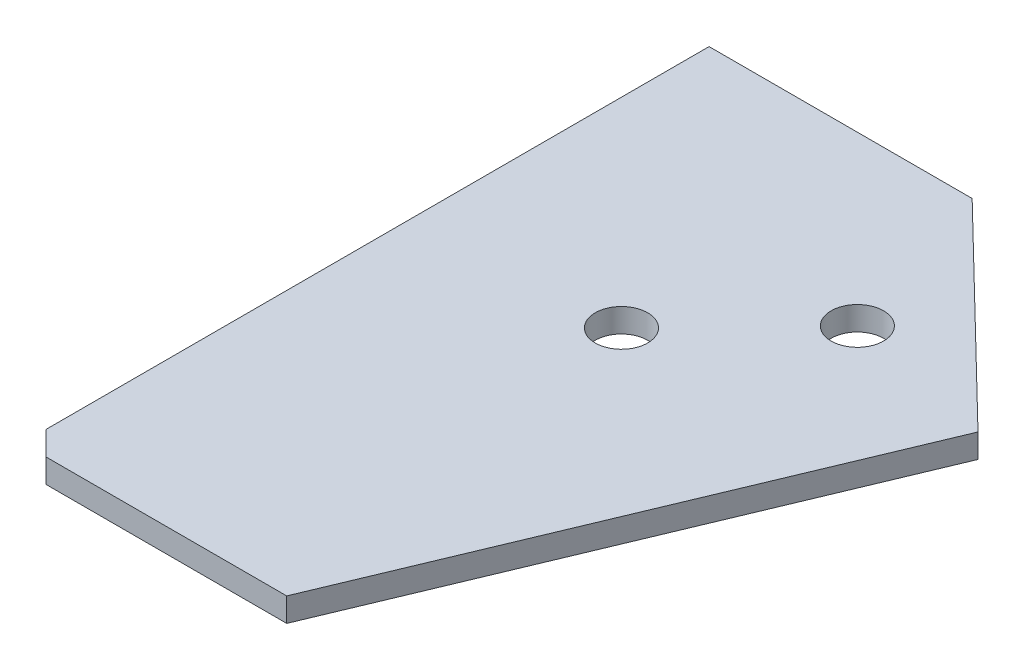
ISO-10303-21;
HEADER;
FILE_DESCRIPTION(('STEP AP214'),'2;1');
FILE_NAME('part.step','',(''),(''),'','','');
FILE_SCHEMA(('AUTOMOTIVE_DESIGN { 1 0 10303 214 1 1 1 1 }'));
ENDSEC;
DATA;
#1=APPLICATION_CONTEXT('core data for automotive mechanical design processes');
#2=APPLICATION_PROTOCOL_DEFINITION('international standard','automotive_design',2000,#1);
#3=PRODUCT_CONTEXT('',#1,'mechanical');
#4=PRODUCT('Part','Part','',(#3));
#5=PRODUCT_RELATED_PRODUCT_CATEGORY('part','',(#4));
#6=PRODUCT_DEFINITION_FORMATION('','',#4);
#7=PRODUCT_DEFINITION_CONTEXT('part definition',#1,'design');
#8=PRODUCT_DEFINITION('design','',#6,#7);
#9=PRODUCT_DEFINITION_SHAPE('','',#8);
#10=(LENGTH_UNIT() NAMED_UNIT(*) SI_UNIT(.MILLI.,.METRE.));
#11=(NAMED_UNIT(*) PLANE_ANGLE_UNIT() SI_UNIT($,.RADIAN.));
#12=(NAMED_UNIT(*) SI_UNIT($,.STERADIAN.) SOLID_ANGLE_UNIT());
#13=UNCERTAINTY_MEASURE_WITH_UNIT(LENGTH_MEASURE(1.E-05),#10,'distance_accuracy_value','');
#14=(GEOMETRIC_REPRESENTATION_CONTEXT(3) GLOBAL_UNCERTAINTY_ASSIGNED_CONTEXT((#13)) GLOBAL_UNIT_ASSIGNED_CONTEXT((#10,
#11,#12)) REPRESENTATION_CONTEXT('',''));
#15=CARTESIAN_POINT('',(0.,0.,0.));
#16=DIRECTION('',(0.,0.,1.));
#17=DIRECTION('',(1.,0.,0.));
#18=AXIS2_PLACEMENT_3D('',#15,#16,#17);
#19=CARTESIAN_POINT('',(0.,5.,0.));
#20=DIRECTION('',(1.,0.,0.));
#21=DIRECTION('',(0.,0.,-1.));
#22=AXIS2_PLACEMENT_3D('',#19,#20,#21);
#23=PLANE('',#22);
#24=DIRECTION('',(0.,0.,1.));
#25=VECTOR('',#24,1.);
#26=CARTESIAN_POINT('',(0.,-5.,0.));
#27=LINE('',#26,#25);
#28=CARTESIAN_POINT('',(0.,-5.,-288.223836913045));
#29=VERTEX_POINT('',#28);
#30=CARTESIAN_POINT('',(0.,-5.,-9.99999999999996));
#31=VERTEX_POINT('',#30);
#32=EDGE_CURVE('E121',#29,#31,#27,.T.);
#33=ORIENTED_EDGE('',*,*,#32,.T.);
#34=DIRECTION('',(0.,1.,0.));
#35=VECTOR('',#34,1.);
#36=CARTESIAN_POINT('',(0.,5.,-9.99999999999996));
#37=LINE('',#36,#35);
#38=CARTESIAN_POINT('',(0.,5.,-9.99999999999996));
#39=VERTEX_POINT('',#38);
#40=EDGE_CURVE('E45',#31,#39,#37,.T.);
#41=ORIENTED_EDGE('',*,*,#40,.T.);
#42=DIRECTION('',(0.,0.,1.));
#43=VECTOR('',#42,1.);
#44=CARTESIAN_POINT('',(0.,5.,0.));
#45=LINE('',#44,#43);
#46=CARTESIAN_POINT('',(0.,5.,-288.223836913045));
#47=VERTEX_POINT('',#46);
#48=EDGE_CURVE('E99',#47,#39,#45,.T.);
#49=ORIENTED_EDGE('',*,*,#48,.F.);
#50=DIRECTION('',(0.,-1.,0.));
#51=VECTOR('',#50,1.);
#52=CARTESIAN_POINT('',(0.,5.,-288.223836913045));
#53=LINE('',#52,#51);
#54=EDGE_CURVE('E120',#47,#29,#53,.T.);
#55=ORIENTED_EDGE('',*,*,#54,.T.);
#56=EDGE_LOOP('',(#33,#41,#49,#55));
#57=FACE_BOUND('',#56,.T.);
#58=ADVANCED_FACE('F37',(#57),#23,.F.);
#59=CARTESIAN_POINT('',(0.,5.,0.));
#60=DIRECTION('',(0.,0.,-1.));
#61=DIRECTION('',(-1.,0.,0.));
#62=AXIS2_PLACEMENT_3D('',#59,#60,#61);
#63=PLANE('',#62);
#64=DIRECTION('',(1.,0.,0.));
#65=VECTOR('',#64,1.);
#66=CARTESIAN_POINT('',(0.,5.,0.));
#67=LINE('',#66,#65);
#68=CARTESIAN_POINT('',(9.99999999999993,5.,0.));
#69=VERTEX_POINT('',#68);
#70=CARTESIAN_POINT('',(111.,5.,0.));
#71=VERTEX_POINT('',#70);
#72=EDGE_CURVE('E89',#69,#71,#67,.T.);
#73=ORIENTED_EDGE('',*,*,#72,.F.);
#74=DIRECTION('',(0.,-1.,0.));
#75=VECTOR('',#74,1.);
#76=CARTESIAN_POINT('',(9.99999999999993,5.,0.));
#77=LINE('',#76,#75);
#78=CARTESIAN_POINT('',(9.99999999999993,-5.,0.));
#79=VERTEX_POINT('',#78);
#80=EDGE_CURVE('E107',#69,#79,#77,.T.);
#81=ORIENTED_EDGE('',*,*,#80,.T.);
#82=DIRECTION('',(1.,0.,0.));
#83=VECTOR('',#82,1.);
#84=CARTESIAN_POINT('',(0.,-5.,0.));
#85=LINE('',#84,#83);
#86=CARTESIAN_POINT('',(111.,-5.,0.));
#87=VERTEX_POINT('',#86);
#88=EDGE_CURVE('E104',#79,#87,#85,.T.);
#89=ORIENTED_EDGE('',*,*,#88,.T.);
#90=DIRECTION('',(0.,-1.,0.));
#91=VECTOR('',#90,1.);
#92=CARTESIAN_POINT('',(111.,5.,0.));
#93=LINE('',#92,#91);
#94=EDGE_CURVE('E102',#71,#87,#93,.T.);
#95=ORIENTED_EDGE('',*,*,#94,.F.);
#96=EDGE_LOOP('',(#73,#81,#89,#95));
#97=FACE_BOUND('',#96,.T.);
#98=ADVANCED_FACE('F103',(#97),#63,.F.);
#99=CARTESIAN_POINT('',(111.,5.,0.));
#100=DIRECTION('',(-0.92275935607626,0.,-0.385376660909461));
#101=DIRECTION('',(-0.385376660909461,0.,0.92275935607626));
#102=AXIS2_PLACEMENT_3D('',#99,#100,#101);
#103=PLANE('',#102);
#104=DIRECTION('',(0.385376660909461,0.,-0.92275935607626));
#105=VECTOR('',#104,1.);
#106=CARTESIAN_POINT('',(111.,-5.,0.));
#107=LINE('',#106,#105);
#108=CARTESIAN_POINT('',(196.451283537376,-5.,-204.607542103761));
#109=VERTEX_POINT('',#108);
#110=EDGE_CURVE('E125',#87,#109,#107,.T.);
#111=ORIENTED_EDGE('',*,*,#110,.T.);
#112=DIRECTION('',(0.,-1.,0.));
#113=VECTOR('',#112,1.);
#114=CARTESIAN_POINT('',(196.451283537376,5.,-204.607542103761));
#115=LINE('',#114,#113);
#116=CARTESIAN_POINT('',(196.451283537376,5.,-204.607542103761));
#117=VERTEX_POINT('',#116);
#118=EDGE_CURVE('E108',#117,#109,#115,.T.);
#119=ORIENTED_EDGE('',*,*,#118,.F.);
#120=DIRECTION('',(0.385376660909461,0.,-0.92275935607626));
#121=VECTOR('',#120,1.);
#122=CARTESIAN_POINT('',(111.,5.,0.));
#123=LINE('',#122,#121);
#124=EDGE_CURVE('E93',#71,#117,#123,.T.);
#125=ORIENTED_EDGE('',*,*,#124,.F.);
#126=ORIENTED_EDGE('',*,*,#94,.T.);
#127=EDGE_LOOP('',(#111,#119,#125,#126));
#128=FACE_BOUND('',#127,.T.);
#129=ADVANCED_FACE('F110',(#128),#103,.F.);
#130=CARTESIAN_POINT('',(110.379713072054,5.,-288.223836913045));
#131=DIRECTION('',(-0.696802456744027,0.,0.717263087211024));
#132=DIRECTION('',(0.717263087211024,0.,0.696802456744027));
#133=AXIS2_PLACEMENT_3D('',#130,#131,#132);
#134=PLANE('',#133);
#135=DIRECTION('',(-0.717263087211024,0.,-0.696802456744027));
#136=VECTOR('',#135,1.);
#137=CARTESIAN_POINT('',(110.379713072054,-5.,-288.223836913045));
#138=LINE('',#137,#136);
#139=CARTESIAN_POINT('',(110.379713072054,-5.,-288.223836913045));
#140=VERTEX_POINT('',#139);
#141=EDGE_CURVE('E127',#109,#140,#138,.T.);
#142=ORIENTED_EDGE('',*,*,#141,.T.);
#143=DIRECTION('',(0.,-1.,0.));
#144=VECTOR('',#143,1.);
#145=CARTESIAN_POINT('',(110.379713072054,5.,-288.223836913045));
#146=LINE('',#145,#144);
#147=CARTESIAN_POINT('',(110.379713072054,5.,-288.223836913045));
#148=VERTEX_POINT('',#147);
#149=EDGE_CURVE('E133',#148,#140,#146,.T.);
#150=ORIENTED_EDGE('',*,*,#149,.F.);
#151=DIRECTION('',(-0.717263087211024,0.,-0.696802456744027));
#152=VECTOR('',#151,1.);
#153=CARTESIAN_POINT('',(110.379713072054,5.,-288.223836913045));
#154=LINE('',#153,#152);
#155=EDGE_CURVE('E113',#117,#148,#154,.T.);
#156=ORIENTED_EDGE('',*,*,#155,.F.);
#157=ORIENTED_EDGE('',*,*,#118,.T.);
#158=EDGE_LOOP('',(#142,#150,#156,#157));
#159=FACE_BOUND('',#158,.T.);
#160=ADVANCED_FACE('F143',(#159),#134,.F.);
#161=CARTESIAN_POINT('',(110.379713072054,5.,-288.223836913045));
#162=DIRECTION('',(0.,0.,1.));
#163=DIRECTION('',(1.,0.,0.));
#164=AXIS2_PLACEMENT_3D('',#161,#162,#163);
#165=PLANE('',#164);
#166=DIRECTION('',(-1.,0.,0.));
#167=VECTOR('',#166,1.);
#168=CARTESIAN_POINT('',(110.379713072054,-5.,-288.223836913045));
#169=LINE('',#168,#167);
#170=EDGE_CURVE('E129',#140,#29,#169,.T.);
#171=ORIENTED_EDGE('',*,*,#170,.T.);
#172=ORIENTED_EDGE('',*,*,#54,.F.);
#173=DIRECTION('',(-1.,0.,0.));
#174=VECTOR('',#173,1.);
#175=CARTESIAN_POINT('',(110.379713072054,5.,-288.223836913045));
#176=LINE('',#175,#174);
#177=EDGE_CURVE('E115',#148,#47,#176,.T.);
#178=ORIENTED_EDGE('',*,*,#177,.F.);
#179=ORIENTED_EDGE('',*,*,#149,.T.);
#180=EDGE_LOOP('',(#171,#172,#178,#179));
#181=FACE_BOUND('',#180,.T.);
#182=ADVANCED_FACE('F148',(#181),#165,.F.);
#183=CARTESIAN_POINT('',(0.,5.,-288.223836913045));
#184=DIRECTION('',(0.,1.,0.));
#185=DIRECTION('',(0.,0.,1.));
#186=AXIS2_PLACEMENT_3D('',#183,#184,#185);
#187=PLANE('',#186);
#188=CARTESIAN_POINT('',(132.613727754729,5.,-217.827469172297));
#189=DIRECTION('',(0.,1.,0.));
#190=DIRECTION('',(0.,0.,1.));
#191=AXIS2_PLACEMENT_3D('',#188,#189,#190);
#192=CIRCLE('',#191,11.);
#193=CARTESIAN_POINT('',(132.613727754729,5.,-206.827469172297));
#194=VERTEX_POINT('',#193);
#195=EDGE_CURVE('E158',#194,#194,#192,.T.);
#196=ORIENTED_EDGE('',*,*,#195,.F.);
#197=EDGE_LOOP('',(#196));
#198=FACE_BOUND('',#197,.T.);
#199=CARTESIAN_POINT('',(83.8375557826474,5.,-167.619053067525));
#200=DIRECTION('',(0.,1.,0.));
#201=DIRECTION('',(0.,0.,1.));
#202=AXIS2_PLACEMENT_3D('',#199,#200,#201);
#203=CIRCLE('',#202,11.);
#204=CARTESIAN_POINT('',(83.8375557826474,5.,-156.619053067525));
#205=VERTEX_POINT('',#204);
#206=EDGE_CURVE('E152',#205,#205,#203,.T.);
#207=ORIENTED_EDGE('',*,*,#206,.F.);
#208=EDGE_LOOP('',(#207));
#209=FACE_BOUND('',#208,.T.);
#210=ORIENTED_EDGE('',*,*,#48,.T.);
#211=DIRECTION('',(-0.707106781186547,0.,-0.707106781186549));
#212=VECTOR('',#211,1.);
#213=CARTESIAN_POINT('',(-139.111918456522,5.,-149.111918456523));
#214=LINE('',#213,#212);
#215=EDGE_CURVE('E11',#39,#69,#214,.F.);
#216=ORIENTED_EDGE('',*,*,#215,.T.);
#217=ORIENTED_EDGE('',*,*,#72,.T.);
#218=ORIENTED_EDGE('',*,*,#124,.T.);
#219=ORIENTED_EDGE('',*,*,#155,.T.);
#220=ORIENTED_EDGE('',*,*,#177,.T.);
#221=EDGE_LOOP('',(#210,#216,#217,#218,#219,#220));
#222=FACE_BOUND('',#221,.T.);
#223=ADVANCED_FACE('F91',(#198,#209,#222),#187,.T.);
#224=CARTESIAN_POINT('',(0.,-5.,-288.223836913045));
#225=DIRECTION('',(0.,1.,0.));
#226=DIRECTION('',(0.,0.,1.));
#227=AXIS2_PLACEMENT_3D('',#224,#225,#226);
#228=PLANE('',#227);
#229=CARTESIAN_POINT('',(132.613727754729,-5.,-217.827469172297));
#230=DIRECTION('',(0.,1.,0.));
#231=DIRECTION('',(0.,0.,1.));
#232=AXIS2_PLACEMENT_3D('',#229,#230,#231);
#233=CIRCLE('',#232,11.);
#234=CARTESIAN_POINT('',(132.613727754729,-5.,-206.827469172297));
#235=VERTEX_POINT('',#234);
#236=EDGE_CURVE('E155',#235,#235,#233,.T.);
#237=ORIENTED_EDGE('',*,*,#236,.T.);
#238=EDGE_LOOP('',(#237));
#239=FACE_BOUND('',#238,.T.);
#240=CARTESIAN_POINT('',(83.8375557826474,-5.,-167.619053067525));
#241=DIRECTION('',(0.,1.,0.));
#242=DIRECTION('',(0.,0.,1.));
#243=AXIS2_PLACEMENT_3D('',#240,#241,#242);
#244=CIRCLE('',#243,11.);
#245=CARTESIAN_POINT('',(83.8375557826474,-5.,-156.619053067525));
#246=VERTEX_POINT('',#245);
#247=EDGE_CURVE('E123',#246,#246,#244,.T.);
#248=ORIENTED_EDGE('',*,*,#247,.T.);
#249=EDGE_LOOP('',(#248));
#250=FACE_BOUND('',#249,.T.);
#251=ORIENTED_EDGE('',*,*,#88,.F.);
#252=DIRECTION('',(0.707106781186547,0.,0.707106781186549));
#253=VECTOR('',#252,1.);
#254=CARTESIAN_POINT('',(9.99999999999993,-5.,0.));
#255=LINE('',#254,#253);
#256=EDGE_CURVE('E59',#79,#31,#255,.F.);
#257=ORIENTED_EDGE('',*,*,#256,.T.);
#258=ORIENTED_EDGE('',*,*,#32,.F.);
#259=ORIENTED_EDGE('',*,*,#170,.F.);
#260=ORIENTED_EDGE('',*,*,#141,.F.);
#261=ORIENTED_EDGE('',*,*,#110,.F.);
#262=EDGE_LOOP('',(#251,#257,#258,#259,#260,#261));
#263=FACE_BOUND('',#262,.T.);
#264=ADVANCED_FACE('F139',(#239,#250,#263),#228,.F.);
#265=CARTESIAN_POINT('',(83.8375557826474,5.,-167.619053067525));
#266=DIRECTION('',(0.,1.,0.));
#267=DIRECTION('',(0.,0.,1.));
#268=AXIS2_PLACEMENT_3D('',#265,#266,#267);
#269=CYLINDRICAL_SURFACE('',#268,11.);
#270=ORIENTED_EDGE('',*,*,#247,.F.);
#271=EDGE_LOOP('',(#270));
#272=FACE_BOUND('',#271,.T.);
#273=ORIENTED_EDGE('',*,*,#206,.T.);
#274=EDGE_LOOP('',(#273));
#275=FACE_BOUND('',#274,.T.);
#276=ADVANCED_FACE('F169',(#272,#275),#269,.F.);
#277=CARTESIAN_POINT('',(132.613727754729,5.,-217.827469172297));
#278=DIRECTION('',(0.,1.,0.));
#279=DIRECTION('',(0.,0.,1.));
#280=AXIS2_PLACEMENT_3D('',#277,#278,#279);
#281=CYLINDRICAL_SURFACE('',#280,11.);
#282=ORIENTED_EDGE('',*,*,#236,.F.);
#283=EDGE_LOOP('',(#282));
#284=FACE_BOUND('',#283,.T.);
#285=ORIENTED_EDGE('',*,*,#195,.T.);
#286=EDGE_LOOP('',(#285));
#287=FACE_BOUND('',#286,.T.);
#288=ADVANCED_FACE('F162',(#284,#287),#281,.F.);
#289=CARTESIAN_POINT('',(9.99999999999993,5.,0.));
#290=DIRECTION('',(0.707106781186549,0.,-0.707106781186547));
#291=DIRECTION('',(-0.707106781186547,0.,-0.707106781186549));
#292=AXIS2_PLACEMENT_3D('',#289,#290,#291);
#293=PLANE('',#292);
#294=ORIENTED_EDGE('',*,*,#215,.F.);
#295=ORIENTED_EDGE('',*,*,#40,.F.);
#296=ORIENTED_EDGE('',*,*,#256,.F.);
#297=ORIENTED_EDGE('',*,*,#80,.F.);
#298=EDGE_LOOP('',(#294,#295,#296,#297));
#299=FACE_BOUND('',#298,.T.);
#300=ADVANCED_FACE('F39',(#299),#293,.F.);
#301=CLOSED_SHELL('',(#58,#98,#129,#160,#182,#223,#264,#276,#288,#300));
#302=MANIFOLD_SOLID_BREP('B2',#301);
#303=ADVANCED_BREP_SHAPE_REPRESENTATION('',(#18,#302),#14);
#304=SHAPE_DEFINITION_REPRESENTATION(#9,#303);
ENDSEC;
END-ISO-10303-21;
